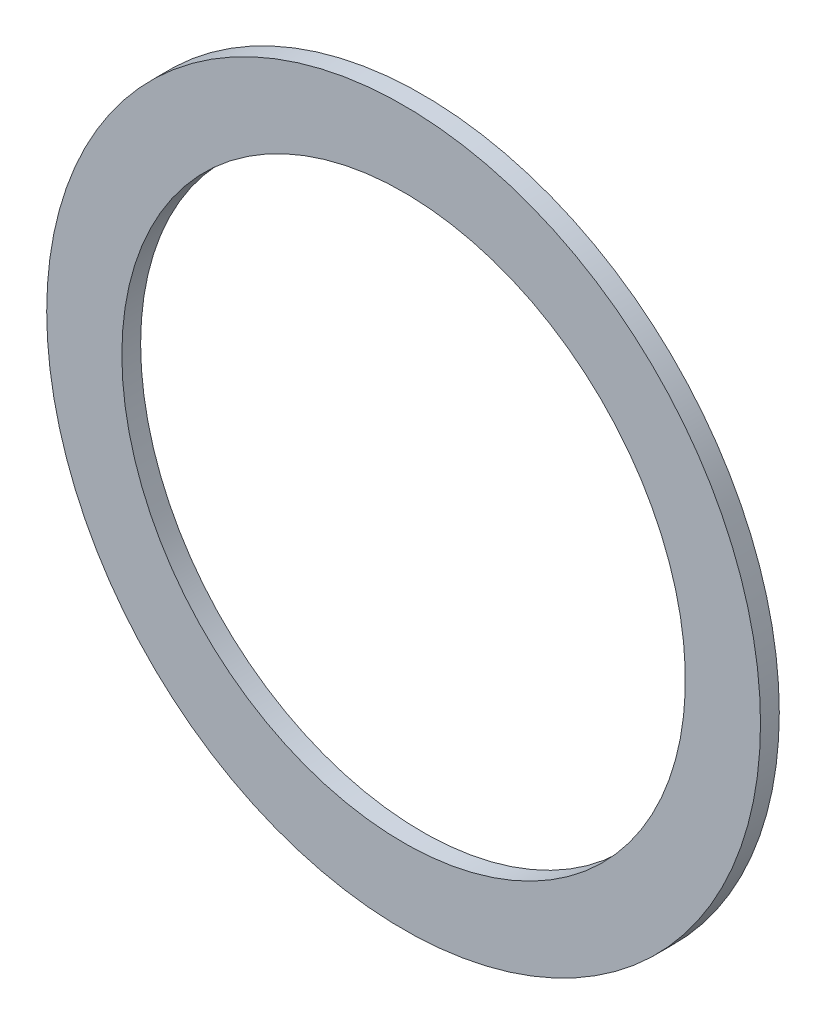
ISO-10303-21;
HEADER;
FILE_DESCRIPTION(('STEP AP214'),'2;1');
FILE_NAME('part.step','',(''),(''),'','','');
FILE_SCHEMA(('AUTOMOTIVE_DESIGN { 1 0 10303 214 1 1 1 1 }'));
ENDSEC;
DATA;
#1=APPLICATION_CONTEXT('core data for automotive mechanical design processes');
#2=APPLICATION_PROTOCOL_DEFINITION('international standard','automotive_design',2000,#1);
#3=PRODUCT_CONTEXT('',#1,'mechanical');
#4=PRODUCT('Part','Part','',(#3));
#5=PRODUCT_RELATED_PRODUCT_CATEGORY('part','',(#4));
#6=PRODUCT_DEFINITION_FORMATION('','',#4);
#7=PRODUCT_DEFINITION_CONTEXT('part definition',#1,'design');
#8=PRODUCT_DEFINITION('design','',#6,#7);
#9=PRODUCT_DEFINITION_SHAPE('','',#8);
#10=(LENGTH_UNIT() NAMED_UNIT(*) SI_UNIT(.MILLI.,.METRE.));
#11=(NAMED_UNIT(*) PLANE_ANGLE_UNIT() SI_UNIT($,.RADIAN.));
#12=(NAMED_UNIT(*) SI_UNIT($,.STERADIAN.) SOLID_ANGLE_UNIT());
#13=UNCERTAINTY_MEASURE_WITH_UNIT(LENGTH_MEASURE(1.E-05),#10,'distance_accuracy_value','');
#14=(GEOMETRIC_REPRESENTATION_CONTEXT(3) GLOBAL_UNCERTAINTY_ASSIGNED_CONTEXT((#13)) GLOBAL_UNIT_ASSIGNED_CONTEXT((#10,
#11,#12)) REPRESENTATION_CONTEXT('',''));
#15=CARTESIAN_POINT('',(0.,0.,0.));
#16=DIRECTION('',(0.,0.,1.));
#17=DIRECTION('',(1.,0.,0.));
#18=AXIS2_PLACEMENT_3D('',#15,#16,#17);
#19=CARTESIAN_POINT('',(0.,0.,1.));
#20=DIRECTION('',(0.,0.,-1.));
#21=DIRECTION('',(-1.,0.,0.));
#22=AXIS2_PLACEMENT_3D('',#19,#20,#21);
#23=CYLINDRICAL_SURFACE('',#22,19.);
#24=CARTESIAN_POINT('',(0.,0.,1.));
#25=DIRECTION('',(0.,0.,1.));
#26=DIRECTION('',(1.,0.,0.));
#27=AXIS2_PLACEMENT_3D('',#24,#25,#26);
#28=CIRCLE('',#27,19.);
#29=CARTESIAN_POINT('',(19.,0.,1.));
#30=VERTEX_POINT('',#29);
#31=EDGE_CURVE('E10',#30,#30,#28,.T.);
#32=ORIENTED_EDGE('',*,*,#31,.F.);
#33=EDGE_LOOP('',(#32));
#34=FACE_BOUND('',#33,.T.);
#35=CARTESIAN_POINT('',(0.,0.,0.));
#36=DIRECTION('',(0.,0.,1.));
#37=DIRECTION('',(1.,0.,0.));
#38=AXIS2_PLACEMENT_3D('',#35,#36,#37);
#39=CIRCLE('',#38,19.);
#40=CARTESIAN_POINT('',(19.,0.,0.));
#41=VERTEX_POINT('',#40);
#42=EDGE_CURVE('E32',#41,#41,#39,.T.);
#43=ORIENTED_EDGE('',*,*,#42,.T.);
#44=EDGE_LOOP('',(#43));
#45=FACE_BOUND('',#44,.T.);
#46=ADVANCED_FACE('F26',(#34,#45),#23,.T.);
#47=CARTESIAN_POINT('',(0.,0.,1.));
#48=DIRECTION('',(0.,0.,1.));
#49=DIRECTION('',(1.,0.,0.));
#50=AXIS2_PLACEMENT_3D('',#47,#48,#49);
#51=PLANE('',#50);
#52=CARTESIAN_POINT('',(0.,0.,1.));
#53=DIRECTION('',(0.,0.,-1.));
#54=DIRECTION('',(-1.,0.,0.));
#55=AXIS2_PLACEMENT_3D('',#52,#53,#54);
#56=CIRCLE('',#55,15.);
#57=CARTESIAN_POINT('',(-15.,0.,1.));
#58=VERTEX_POINT('',#57);
#59=EDGE_CURVE('E36',#58,#58,#56,.T.);
#60=ORIENTED_EDGE('',*,*,#59,.T.);
#61=EDGE_LOOP('',(#60));
#62=FACE_BOUND('',#61,.T.);
#63=ORIENTED_EDGE('',*,*,#31,.T.);
#64=EDGE_LOOP('',(#63));
#65=FACE_BOUND('',#64,.T.);
#66=ADVANCED_FACE('F51',(#62,#65),#51,.T.);
#67=CARTESIAN_POINT('',(0.,0.,0.));
#68=DIRECTION('',(0.,0.,1.));
#69=DIRECTION('',(1.,0.,0.));
#70=AXIS2_PLACEMENT_3D('',#67,#68,#69);
#71=PLANE('',#70);
#72=CARTESIAN_POINT('',(0.,0.,0.));
#73=DIRECTION('',(0.,0.,-1.));
#74=DIRECTION('',(-1.,0.,0.));
#75=AXIS2_PLACEMENT_3D('',#72,#73,#74);
#76=CIRCLE('',#75,15.);
#77=CARTESIAN_POINT('',(-15.,0.,0.));
#78=VERTEX_POINT('',#77);
#79=EDGE_CURVE('E40',#78,#78,#76,.T.);
#80=ORIENTED_EDGE('',*,*,#79,.F.);
#81=EDGE_LOOP('',(#80));
#82=FACE_BOUND('',#81,.T.);
#83=ORIENTED_EDGE('',*,*,#42,.F.);
#84=EDGE_LOOP('',(#83));
#85=FACE_BOUND('',#84,.T.);
#86=ADVANCED_FACE('F48',(#82,#85),#71,.F.);
#87=CARTESIAN_POINT('',(0.,0.,1.));
#88=DIRECTION('',(0.,0.,-1.));
#89=DIRECTION('',(-1.,0.,0.));
#90=AXIS2_PLACEMENT_3D('',#87,#88,#89);
#91=CYLINDRICAL_SURFACE('',#90,15.);
#92=ORIENTED_EDGE('',*,*,#59,.F.);
#93=EDGE_LOOP('',(#92));
#94=FACE_BOUND('',#93,.T.);
#95=ORIENTED_EDGE('',*,*,#79,.T.);
#96=EDGE_LOOP('',(#95));
#97=FACE_BOUND('',#96,.T.);
#98=ADVANCED_FACE('F46',(#94,#97),#91,.F.);
#99=CLOSED_SHELL('',(#46,#66,#86,#98));
#100=MANIFOLD_SOLID_BREP('B2',#99);
#101=ADVANCED_BREP_SHAPE_REPRESENTATION('',(#18,#100),#14);
#102=SHAPE_DEFINITION_REPRESENTATION(#9,#101);
ENDSEC;
END-ISO-10303-21;
